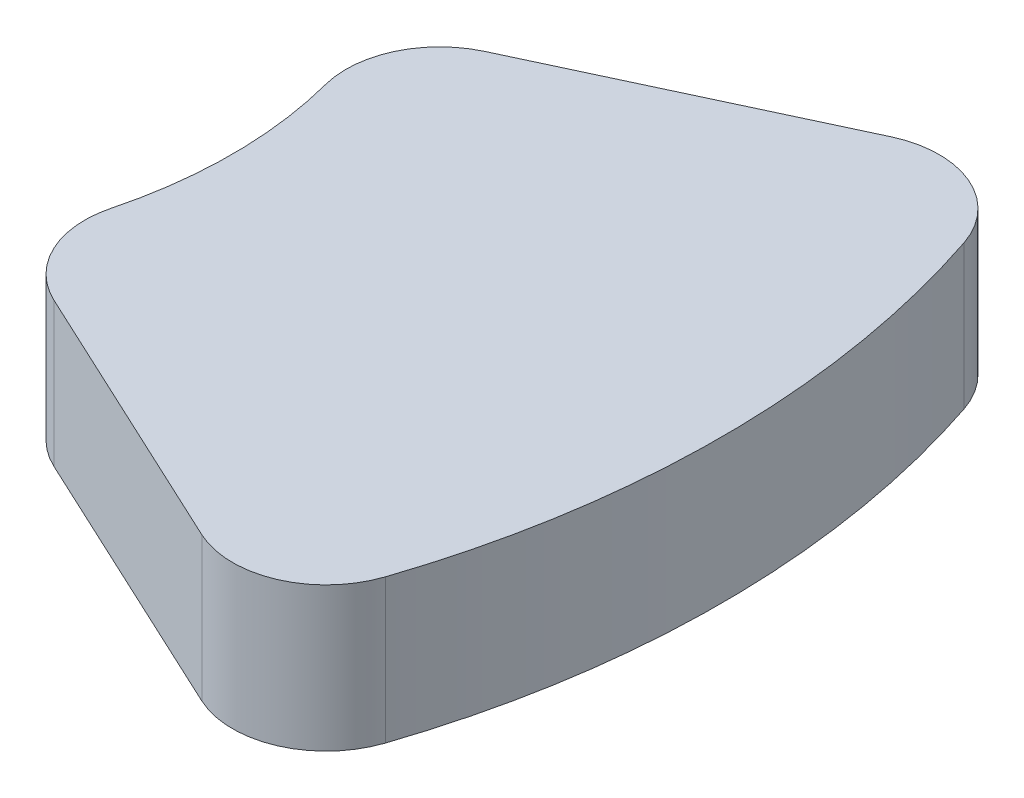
ISO-10303-21;
HEADER;
FILE_DESCRIPTION(('STEP AP214'),'2;1');
FILE_NAME('part.step','',(''),(''),'','','');
FILE_SCHEMA(('AUTOMOTIVE_DESIGN { 1 0 10303 214 1 1 1 1 }'));
ENDSEC;
DATA;
#1=APPLICATION_CONTEXT('core data for automotive mechanical design processes');
#2=APPLICATION_PROTOCOL_DEFINITION('international standard','automotive_design',2000,#1);
#3=PRODUCT_CONTEXT('',#1,'mechanical');
#4=PRODUCT('Part','Part','',(#3));
#5=PRODUCT_RELATED_PRODUCT_CATEGORY('part','',(#4));
#6=PRODUCT_DEFINITION_FORMATION('','',#4);
#7=PRODUCT_DEFINITION_CONTEXT('part definition',#1,'design');
#8=PRODUCT_DEFINITION('design','',#6,#7);
#9=PRODUCT_DEFINITION_SHAPE('','',#8);
#10=(LENGTH_UNIT() NAMED_UNIT(*) SI_UNIT(.MILLI.,.METRE.));
#11=(NAMED_UNIT(*) PLANE_ANGLE_UNIT() SI_UNIT($,.RADIAN.));
#12=(NAMED_UNIT(*) SI_UNIT($,.STERADIAN.) SOLID_ANGLE_UNIT());
#13=UNCERTAINTY_MEASURE_WITH_UNIT(LENGTH_MEASURE(1.E-05),#10,'distance_accuracy_value','');
#14=(GEOMETRIC_REPRESENTATION_CONTEXT(3) GLOBAL_UNCERTAINTY_ASSIGNED_CONTEXT((#13)) GLOBAL_UNIT_ASSIGNED_CONTEXT((#10,
#11,#12)) REPRESENTATION_CONTEXT('',''));
#15=CARTESIAN_POINT('',(0.,0.,0.));
#16=DIRECTION('',(0.,0.,1.));
#17=DIRECTION('',(1.,0.,0.));
#18=AXIS2_PLACEMENT_3D('',#15,#16,#17);
#19=CARTESIAN_POINT('',(-22.8041269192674,2.32076201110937,24.541099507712));
#20=DIRECTION('',(0.,-1.,0.));
#21=DIRECTION('',(0.,0.,-1.));
#22=AXIS2_PLACEMENT_3D('',#19,#20,#21);
#23=CYLINDRICAL_SURFACE('',#22,14.75);
#24=CARTESIAN_POINT('',(-22.8041269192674,2.32076201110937,24.541099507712));
#25=DIRECTION('',(0.,-1.,0.));
#26=DIRECTION('',(0.,0.,1.));
#27=AXIS2_PLACEMENT_3D('',#24,#25,#26);
#28=CIRCLE('',#27,14.75);
#29=CARTESIAN_POINT('',(-8.53027902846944,2.32076201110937,20.8236048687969));
#30=VERTEX_POINT('',#29);
#31=CARTESIAN_POINT('',(-8.53027902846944,2.32076201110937,28.2585941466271));
#32=VERTEX_POINT('',#31);
#33=EDGE_CURVE('E101',#30,#32,#28,.T.);
#34=ORIENTED_EDGE('',*,*,#33,.F.);
#35=DIRECTION('',(0.,-1.,0.));
#36=VECTOR('',#35,1.);
#37=CARTESIAN_POINT('',(-8.53027902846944,2.32076201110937,20.8236048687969));
#38=LINE('',#37,#36);
#39=CARTESIAN_POINT('',(-8.53027902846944,-2.67923798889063,20.8236048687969));
#40=VERTEX_POINT('',#39);
#41=EDGE_CURVE('E86',#30,#40,#38,.T.);
#42=ORIENTED_EDGE('',*,*,#41,.T.);
#43=CARTESIAN_POINT('',(-22.8041269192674,-2.67923798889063,24.541099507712));
#44=DIRECTION('',(0.,-1.,0.));
#45=DIRECTION('',(0.,0.,1.));
#46=AXIS2_PLACEMENT_3D('',#43,#44,#45);
#47=CIRCLE('',#46,14.75);
#48=CARTESIAN_POINT('',(-8.53027902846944,-2.67923798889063,28.2585941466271));
#49=VERTEX_POINT('',#48);
#50=EDGE_CURVE('E98',#40,#49,#47,.T.);
#51=ORIENTED_EDGE('',*,*,#50,.T.);
#52=DIRECTION('',(0.,-1.,0.));
#53=VECTOR('',#52,1.);
#54=CARTESIAN_POINT('',(-8.53027902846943,2.32076201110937,28.2585941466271));
#55=LINE('',#54,#53);
#56=EDGE_CURVE('E103',#49,#32,#55,.F.);
#57=ORIENTED_EDGE('',*,*,#56,.T.);
#58=EDGE_LOOP('',(#34,#42,#51,#57));
#59=FACE_BOUND('',#58,.T.);
#60=ADVANCED_FACE('F16',(#59),#23,.F.);
#61=CARTESIAN_POINT('',(-9.43608706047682,2.32076201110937,30.7747188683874));
#62=DIRECTION('',(0.4226182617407,0.,-0.90630778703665));
#63=DIRECTION('',(-0.90630778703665,0.,-0.4226182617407));
#64=AXIS2_PLACEMENT_3D('',#61,#62,#63);
#65=PLANE('',#64);
#66=DIRECTION('',(0.90630778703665,0.,0.4226182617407));
#67=VECTOR('',#66,1.);
#68=CARTESIAN_POINT('',(-9.43608706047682,2.32076201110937,30.7747188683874));
#69=LINE('',#68,#67);
#70=CARTESIAN_POINT('',(-6.7587032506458,2.32076201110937,32.0232034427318));
#71=VERTEX_POINT('',#70);
#72=CARTESIAN_POINT('',(2.8571502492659,2.32076201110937,36.5071495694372));
#73=VERTEX_POINT('',#72);
#74=EDGE_CURVE('E143',#71,#73,#69,.T.);
#75=ORIENTED_EDGE('',*,*,#74,.F.);
#76=DIRECTION('',(0.,-1.,0.));
#77=VECTOR('',#76,1.);
#78=CARTESIAN_POINT('',(-6.7587032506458,2.32076201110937,32.0232034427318));
#79=LINE('',#78,#77);
#80=CARTESIAN_POINT('',(-6.7587032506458,-2.67923798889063,32.0232034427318));
#81=VERTEX_POINT('',#80);
#82=EDGE_CURVE('E136',#71,#81,#79,.T.);
#83=ORIENTED_EDGE('',*,*,#82,.T.);
#84=DIRECTION('',(0.90630778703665,0.,0.4226182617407));
#85=VECTOR('',#84,1.);
#86=CARTESIAN_POINT('',(-9.43608706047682,-2.67923798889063,30.7747188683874));
#87=LINE('',#86,#85);
#88=CARTESIAN_POINT('',(2.8571502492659,-2.67923798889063,36.5071495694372));
#89=VERTEX_POINT('',#88);
#90=EDGE_CURVE('E107',#81,#89,#87,.T.);
#91=ORIENTED_EDGE('',*,*,#90,.T.);
#92=DIRECTION('',(0.,-1.,0.));
#93=VECTOR('',#92,1.);
#94=CARTESIAN_POINT('',(2.8571502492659,2.32076201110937,36.5071495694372));
#95=LINE('',#94,#93);
#96=EDGE_CURVE('E134',#89,#73,#95,.F.);
#97=ORIENTED_EDGE('',*,*,#96,.T.);
#98=EDGE_LOOP('',(#75,#83,#91,#97));
#99=FACE_BOUND('',#98,.T.);
#100=ADVANCED_FACE('F141',(#99),#65,.F.);
#101=CARTESIAN_POINT('',(-22.8041269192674,2.32076201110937,24.541099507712));
#102=DIRECTION('',(0.,-1.,0.));
#103=DIRECTION('',(0.,0.,-1.));
#104=AXIS2_PLACEMENT_3D('',#101,#102,#103);
#105=CYLINDRICAL_SURFACE('',#104,31.75);
#106=CARTESIAN_POINT('',(-22.8041269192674,2.32076201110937,24.541099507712));
#107=DIRECTION('',(0.,1.,0.));
#108=DIRECTION('',(0.,0.,1.));
#109=AXIS2_PLACEMENT_3D('',#106,#107,#108);
#110=CIRCLE('',#109,31.75);
#111=CARTESIAN_POINT('',(7.31357385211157,2.32076201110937,34.5903084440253));
#112=VERTEX_POINT('',#111);
#113=CARTESIAN_POINT('',(7.31357385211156,2.32076201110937,14.4918905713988));
#114=VERTEX_POINT('',#113);
#115=EDGE_CURVE('E151',#112,#114,#110,.T.);
#116=ORIENTED_EDGE('',*,*,#115,.F.);
#117=DIRECTION('',(0.,-1.,0.));
#118=VECTOR('',#117,1.);
#119=CARTESIAN_POINT('',(7.31357385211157,2.32076201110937,34.5903084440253));
#120=LINE('',#119,#118);
#121=CARTESIAN_POINT('',(7.31357385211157,-2.67923798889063,34.5903084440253));
#122=VERTEX_POINT('',#121);
#123=EDGE_CURVE('E10',#112,#122,#120,.T.);
#124=ORIENTED_EDGE('',*,*,#123,.T.);
#125=CARTESIAN_POINT('',(-22.8041269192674,-2.67923798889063,24.541099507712));
#126=DIRECTION('',(0.,1.,0.));
#127=DIRECTION('',(0.,0.,1.));
#128=AXIS2_PLACEMENT_3D('',#125,#126,#127);
#129=CIRCLE('',#128,31.75);
#130=CARTESIAN_POINT('',(7.31357385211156,-2.67923798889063,14.4918905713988));
#131=VERTEX_POINT('',#130);
#132=EDGE_CURVE('E110',#122,#131,#129,.T.);
#133=ORIENTED_EDGE('',*,*,#132,.T.);
#134=DIRECTION('',(0.,-1.,0.));
#135=VECTOR('',#134,1.);
#136=CARTESIAN_POINT('',(7.31357385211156,2.32076201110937,14.4918905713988));
#137=LINE('',#136,#135);
#138=EDGE_CURVE('E24',#131,#114,#137,.F.);
#139=ORIENTED_EDGE('',*,*,#138,.T.);
#140=EDGE_LOOP('',(#116,#124,#133,#139));
#141=FACE_BOUND('',#140,.T.);
#142=ADVANCED_FACE('F150',(#141),#105,.T.);
#143=CARTESIAN_POINT('',(-9.43608706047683,2.32076201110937,18.3074801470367));
#144=DIRECTION('',(0.422618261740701,0.,0.906307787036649));
#145=DIRECTION('',(0.906307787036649,0.,-0.422618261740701));
#146=AXIS2_PLACEMENT_3D('',#143,#144,#145);
#147=PLANE('',#146);
#148=DIRECTION('',(-0.906307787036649,0.,0.422618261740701));
#149=VECTOR('',#148,1.);
#150=CARTESIAN_POINT('',(-9.43608706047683,-2.67923798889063,18.3074801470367));
#151=LINE('',#150,#149);
#152=CARTESIAN_POINT('',(2.85715024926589,-2.67923798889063,12.5750494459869));
#153=VERTEX_POINT('',#152);
#154=CARTESIAN_POINT('',(-6.75870325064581,-2.67923798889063,17.0589955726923));
#155=VERTEX_POINT('',#154);
#156=EDGE_CURVE('E117',#153,#155,#151,.T.);
#157=ORIENTED_EDGE('',*,*,#156,.T.);
#158=DIRECTION('',(0.,-1.,0.));
#159=VECTOR('',#158,1.);
#160=CARTESIAN_POINT('',(-6.75870325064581,2.32076201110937,17.0589955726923));
#161=LINE('',#160,#159);
#162=CARTESIAN_POINT('',(-6.75870325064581,2.32076201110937,17.0589955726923));
#163=VERTEX_POINT('',#162);
#164=EDGE_CURVE('E87',#155,#163,#161,.F.);
#165=ORIENTED_EDGE('',*,*,#164,.T.);
#166=DIRECTION('',(-0.906307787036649,0.,0.422618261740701));
#167=VECTOR('',#166,1.);
#168=CARTESIAN_POINT('',(-9.43608706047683,2.32076201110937,18.3074801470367));
#169=LINE('',#168,#167);
#170=CARTESIAN_POINT('',(2.85715024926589,2.32076201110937,12.5750494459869));
#171=VERTEX_POINT('',#170);
#172=EDGE_CURVE('E113',#171,#163,#169,.T.);
#173=ORIENTED_EDGE('',*,*,#172,.F.);
#174=DIRECTION('',(0.,-1.,0.));
#175=VECTOR('',#174,1.);
#176=CARTESIAN_POINT('',(2.85715024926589,2.32076201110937,12.5750494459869));
#177=LINE('',#176,#175);
#178=EDGE_CURVE('E92',#171,#153,#177,.T.);
#179=ORIENTED_EDGE('',*,*,#178,.T.);
#180=EDGE_LOOP('',(#157,#165,#173,#179));
#181=FACE_BOUND('',#180,.T.);
#182=ADVANCED_FACE('F175',(#181),#147,.F.);
#183=CARTESIAN_POINT('',(-22.8041269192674,2.32076201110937,24.541099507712));
#184=DIRECTION('',(0.,1.,0.));
#185=DIRECTION('',(0.,0.,1.));
#186=AXIS2_PLACEMENT_3D('',#183,#184,#185);
#187=PLANE('',#186);
#188=ORIENTED_EDGE('',*,*,#172,.T.);
#189=CARTESIAN_POINT('',(-5.38519389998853,2.32076201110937,20.0044958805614));
#190=DIRECTION('',(0.,1.,0.));
#191=DIRECTION('',(0.,0.,1.));
#192=AXIS2_PLACEMENT_3D('',#189,#190,#191);
#193=CIRCLE('',#192,3.25);
#194=EDGE_CURVE('E132',#163,#30,#193,.T.);
#195=ORIENTED_EDGE('',*,*,#194,.T.);
#196=ORIENTED_EDGE('',*,*,#33,.T.);
#197=CARTESIAN_POINT('',(-5.38519389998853,2.32076201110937,29.0777031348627));
#198=DIRECTION('',(0.,1.,0.));
#199=DIRECTION('',(0.,0.,1.));
#200=AXIS2_PLACEMENT_3D('',#197,#198,#199);
#201=CIRCLE('',#200,3.25);
#202=EDGE_CURVE('E130',#32,#71,#201,.T.);
#203=ORIENTED_EDGE('',*,*,#202,.T.);
#204=ORIENTED_EDGE('',*,*,#74,.T.);
#205=CARTESIAN_POINT('',(4.23065959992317,2.32076201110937,33.5616492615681));
#206=DIRECTION('',(0.,1.,0.));
#207=DIRECTION('',(0.,0.,1.));
#208=AXIS2_PLACEMENT_3D('',#205,#206,#207);
#209=CIRCLE('',#208,3.25);
#210=EDGE_CURVE('E37',#73,#112,#209,.T.);
#211=ORIENTED_EDGE('',*,*,#210,.T.);
#212=ORIENTED_EDGE('',*,*,#115,.T.);
#213=CARTESIAN_POINT('',(4.23065959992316,2.32076201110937,15.520549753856));
#214=DIRECTION('',(0.,1.,0.));
#215=DIRECTION('',(0.,0.,1.));
#216=AXIS2_PLACEMENT_3D('',#213,#214,#215);
#217=CIRCLE('',#216,3.25);
#218=EDGE_CURVE('E127',#114,#171,#217,.T.);
#219=ORIENTED_EDGE('',*,*,#218,.T.);
#220=EDGE_LOOP('',(#188,#195,#196,#203,#204,#211,#212,#219));
#221=FACE_BOUND('',#220,.T.);
#222=ADVANCED_FACE('F156',(#221),#187,.T.);
#223=CARTESIAN_POINT('',(-22.8041269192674,-2.67923798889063,24.541099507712));
#224=DIRECTION('',(0.,1.,0.));
#225=DIRECTION('',(0.,0.,1.));
#226=AXIS2_PLACEMENT_3D('',#223,#224,#225);
#227=PLANE('',#226);
#228=ORIENTED_EDGE('',*,*,#50,.F.);
#229=CARTESIAN_POINT('',(-5.38519389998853,-2.67923798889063,20.0044958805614));
#230=DIRECTION('',(0.,1.,0.));
#231=DIRECTION('',(0.,0.,1.));
#232=AXIS2_PLACEMENT_3D('',#229,#230,#231);
#233=CIRCLE('',#232,3.25);
#234=EDGE_CURVE('E82',#40,#155,#233,.F.);
#235=ORIENTED_EDGE('',*,*,#234,.T.);
#236=ORIENTED_EDGE('',*,*,#156,.F.);
#237=CARTESIAN_POINT('',(4.23065959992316,-2.67923798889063,15.520549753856));
#238=DIRECTION('',(0.,1.,0.));
#239=DIRECTION('',(0.,0.,1.));
#240=AXIS2_PLACEMENT_3D('',#237,#238,#239);
#241=CIRCLE('',#240,3.25);
#242=EDGE_CURVE('E102',#153,#131,#241,.F.);
#243=ORIENTED_EDGE('',*,*,#242,.T.);
#244=ORIENTED_EDGE('',*,*,#132,.F.);
#245=CARTESIAN_POINT('',(4.23065959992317,-2.67923798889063,33.5616492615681));
#246=DIRECTION('',(0.,1.,0.));
#247=DIRECTION('',(0.,0.,1.));
#248=AXIS2_PLACEMENT_3D('',#245,#246,#247);
#249=CIRCLE('',#248,3.25);
#250=EDGE_CURVE('E121',#122,#89,#249,.F.);
#251=ORIENTED_EDGE('',*,*,#250,.T.);
#252=ORIENTED_EDGE('',*,*,#90,.F.);
#253=CARTESIAN_POINT('',(-5.38519389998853,-2.67923798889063,29.0777031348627));
#254=DIRECTION('',(0.,1.,0.));
#255=DIRECTION('',(0.,0.,1.));
#256=AXIS2_PLACEMENT_3D('',#253,#254,#255);
#257=CIRCLE('',#256,3.25);
#258=EDGE_CURVE('E93',#81,#49,#257,.F.);
#259=ORIENTED_EDGE('',*,*,#258,.T.);
#260=EDGE_LOOP('',(#228,#235,#236,#243,#244,#251,#252,#259));
#261=FACE_BOUND('',#260,.T.);
#262=ADVANCED_FACE('F105',(#261),#227,.F.);
#263=CARTESIAN_POINT('',(-5.38519389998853,2.32076201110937,20.0044958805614));
#264=DIRECTION('',(0.,-1.,0.));
#265=DIRECTION('',(0.,0.,-1.));
#266=AXIS2_PLACEMENT_3D('',#263,#264,#265);
#267=CYLINDRICAL_SURFACE('',#266,3.25);
#268=ORIENTED_EDGE('',*,*,#194,.F.);
#269=ORIENTED_EDGE('',*,*,#164,.F.);
#270=ORIENTED_EDGE('',*,*,#234,.F.);
#271=ORIENTED_EDGE('',*,*,#41,.F.);
#272=EDGE_LOOP('',(#268,#269,#270,#271));
#273=FACE_BOUND('',#272,.T.);
#274=ADVANCED_FACE('F85',(#273),#267,.T.);
#275=CARTESIAN_POINT('',(-5.38519389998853,2.32076201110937,29.0777031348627));
#276=DIRECTION('',(0.,-1.,0.));
#277=DIRECTION('',(0.,0.,-1.));
#278=AXIS2_PLACEMENT_3D('',#275,#276,#277);
#279=CYLINDRICAL_SURFACE('',#278,3.25);
#280=ORIENTED_EDGE('',*,*,#202,.F.);
#281=ORIENTED_EDGE('',*,*,#56,.F.);
#282=ORIENTED_EDGE('',*,*,#258,.F.);
#283=ORIENTED_EDGE('',*,*,#82,.F.);
#284=EDGE_LOOP('',(#280,#281,#282,#283));
#285=FACE_BOUND('',#284,.T.);
#286=ADVANCED_FACE('F157',(#285),#279,.T.);
#287=CARTESIAN_POINT('',(4.23065959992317,2.32076201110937,33.5616492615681));
#288=DIRECTION('',(0.,-1.,0.));
#289=DIRECTION('',(0.,0.,-1.));
#290=AXIS2_PLACEMENT_3D('',#287,#288,#289);
#291=CYLINDRICAL_SURFACE('',#290,3.25);
#292=ORIENTED_EDGE('',*,*,#210,.F.);
#293=ORIENTED_EDGE('',*,*,#96,.F.);
#294=ORIENTED_EDGE('',*,*,#250,.F.);
#295=ORIENTED_EDGE('',*,*,#123,.F.);
#296=EDGE_LOOP('',(#292,#293,#294,#295));
#297=FACE_BOUND('',#296,.T.);
#298=ADVANCED_FACE('F149',(#297),#291,.T.);
#299=CARTESIAN_POINT('',(4.23065959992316,2.32076201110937,15.520549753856));
#300=DIRECTION('',(0.,-1.,0.));
#301=DIRECTION('',(0.,0.,-1.));
#302=AXIS2_PLACEMENT_3D('',#299,#300,#301);
#303=CYLINDRICAL_SURFACE('',#302,3.25);
#304=ORIENTED_EDGE('',*,*,#218,.F.);
#305=ORIENTED_EDGE('',*,*,#138,.F.);
#306=ORIENTED_EDGE('',*,*,#242,.F.);
#307=ORIENTED_EDGE('',*,*,#178,.F.);
#308=EDGE_LOOP('',(#304,#305,#306,#307));
#309=FACE_BOUND('',#308,.T.);
#310=ADVANCED_FACE('F18',(#309),#303,.T.);
#311=CLOSED_SHELL('',(#60,#100,#142,#182,#222,#262,#274,#286,#298,#310));
#312=MANIFOLD_SOLID_BREP('B1',#311);
#313=ADVANCED_BREP_SHAPE_REPRESENTATION('',(#18,#312),#14);
#314=SHAPE_DEFINITION_REPRESENTATION(#9,#313);
ENDSEC;
END-ISO-10303-21;
